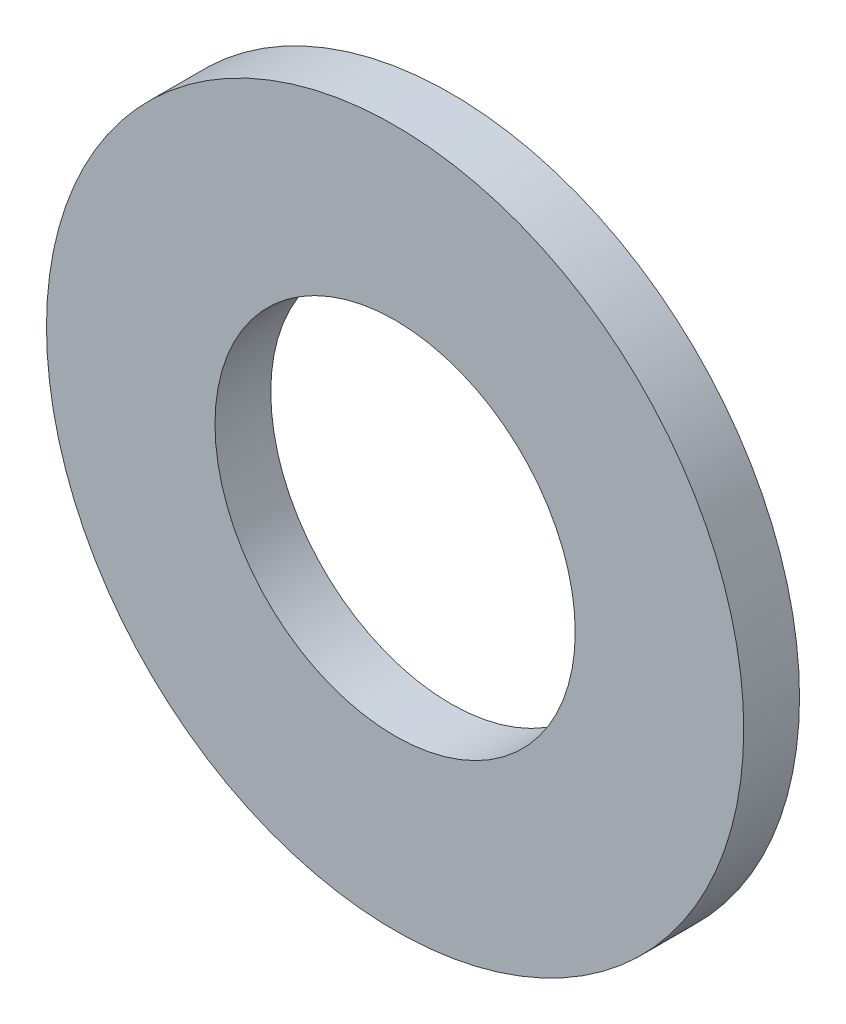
ISO-10303-21;
HEADER;
FILE_DESCRIPTION(('STEP AP214'),'2;1');
FILE_NAME('part.step','',(''),(''),'','','');
FILE_SCHEMA(('AUTOMOTIVE_DESIGN { 1 0 10303 214 1 1 1 1 }'));
ENDSEC;
DATA;
#1=APPLICATION_CONTEXT('core data for automotive mechanical design processes');
#2=APPLICATION_PROTOCOL_DEFINITION('international standard','automotive_design',2000,#1);
#3=PRODUCT_CONTEXT('',#1,'mechanical');
#4=PRODUCT('Part','Part','',(#3));
#5=PRODUCT_RELATED_PRODUCT_CATEGORY('part','',(#4));
#6=PRODUCT_DEFINITION_FORMATION('','',#4);
#7=PRODUCT_DEFINITION_CONTEXT('part definition',#1,'design');
#8=PRODUCT_DEFINITION('design','',#6,#7);
#9=PRODUCT_DEFINITION_SHAPE('','',#8);
#10=(LENGTH_UNIT() NAMED_UNIT(*) SI_UNIT(.MILLI.,.METRE.));
#11=(NAMED_UNIT(*) PLANE_ANGLE_UNIT() SI_UNIT($,.RADIAN.));
#12=(NAMED_UNIT(*) SI_UNIT($,.STERADIAN.) SOLID_ANGLE_UNIT());
#13=UNCERTAINTY_MEASURE_WITH_UNIT(LENGTH_MEASURE(1.E-05),#10,'distance_accuracy_value','');
#14=(GEOMETRIC_REPRESENTATION_CONTEXT(3) GLOBAL_UNCERTAINTY_ASSIGNED_CONTEXT((#13)) GLOBAL_UNIT_ASSIGNED_CONTEXT((#10,
#11,#12)) REPRESENTATION_CONTEXT('',''));
#15=CARTESIAN_POINT('',(0.,0.,0.));
#16=DIRECTION('',(0.,0.,1.));
#17=DIRECTION('',(1.,0.,0.));
#18=AXIS2_PLACEMENT_3D('',#15,#16,#17);
#19=CARTESIAN_POINT('',(0.,0.,1.524));
#20=DIRECTION('',(0.,0.,1.));
#21=DIRECTION('',(1.,0.,0.));
#22=AXIS2_PLACEMENT_3D('',#19,#20,#21);
#23=PLANE('',#22);
#24=CARTESIAN_POINT('',(0.,0.,1.524));
#25=DIRECTION('',(0.,0.,1.));
#26=DIRECTION('',(1.,0.,0.));
#27=AXIS2_PLACEMENT_3D('',#24,#25,#26);
#28=CIRCLE('',#27,9.525);
#29=CARTESIAN_POINT('',(-9.525,0.,1.524));
#30=VERTEX_POINT('',#29);
#31=EDGE_CURVE('E10',#30,#30,#28,.T.);
#32=ORIENTED_EDGE('',*,*,#31,.T.);
#33=EDGE_LOOP('',(#32));
#34=FACE_BOUND('',#33,.T.);
#35=CARTESIAN_POINT('',(0.,0.,1.524));
#36=DIRECTION('',(0.,0.,1.));
#37=DIRECTION('',(1.,0.,0.));
#38=AXIS2_PLACEMENT_3D('',#35,#36,#37);
#39=CIRCLE('',#38,4.92125);
#40=CARTESIAN_POINT('',(-4.92125,0.,1.524));
#41=VERTEX_POINT('',#40);
#42=EDGE_CURVE('E39',#41,#41,#39,.T.);
#43=ORIENTED_EDGE('',*,*,#42,.F.);
#44=EDGE_LOOP('',(#43));
#45=FACE_BOUND('',#44,.T.);
#46=ADVANCED_FACE('F28',(#34,#45),#23,.T.);
#47=CARTESIAN_POINT('',(0.,0.,0.));
#48=DIRECTION('',(0.,0.,1.));
#49=DIRECTION('',(1.,0.,0.));
#50=AXIS2_PLACEMENT_3D('',#47,#48,#49);
#51=PLANE('',#50);
#52=CARTESIAN_POINT('',(0.,0.,0.));
#53=DIRECTION('',(0.,0.,1.));
#54=DIRECTION('',(1.,0.,0.));
#55=AXIS2_PLACEMENT_3D('',#52,#53,#54);
#56=CIRCLE('',#55,9.525);
#57=CARTESIAN_POINT('',(-9.525,0.,0.));
#58=VERTEX_POINT('',#57);
#59=EDGE_CURVE('E35',#58,#58,#56,.T.);
#60=ORIENTED_EDGE('',*,*,#59,.F.);
#61=EDGE_LOOP('',(#60));
#62=FACE_BOUND('',#61,.T.);
#63=CARTESIAN_POINT('',(0.,0.,0.));
#64=DIRECTION('',(0.,0.,1.));
#65=DIRECTION('',(1.,0.,0.));
#66=AXIS2_PLACEMENT_3D('',#63,#64,#65);
#67=CIRCLE('',#66,4.92125);
#68=CARTESIAN_POINT('',(-4.92125,0.,0.));
#69=VERTEX_POINT('',#68);
#70=EDGE_CURVE('E43',#69,#69,#67,.T.);
#71=ORIENTED_EDGE('',*,*,#70,.T.);
#72=EDGE_LOOP('',(#71));
#73=FACE_BOUND('',#72,.T.);
#74=ADVANCED_FACE('F49',(#62,#73),#51,.F.);
#75=CARTESIAN_POINT('',(0.,0.,1.524));
#76=DIRECTION('',(0.,0.,-1.));
#77=DIRECTION('',(-1.,0.,0.));
#78=AXIS2_PLACEMENT_3D('',#75,#76,#77);
#79=CYLINDRICAL_SURFACE('',#78,9.525);
#80=CARTESIAN_POINT('',(-9.525,0.,1.524));
#81=CARTESIAN_POINT('',(-9.525,0.,1.508125));
#82=CARTESIAN_POINT('',(-9.525,0.,1.49225));
#83=CARTESIAN_POINT('',(-9.525,0.,1.4605));
#84=CARTESIAN_POINT('',(-9.525,0.,1.444625));
#85=CARTESIAN_POINT('',(-9.525,0.,1.412875));
#86=CARTESIAN_POINT('',(-9.525,0.,1.397));
#87=CARTESIAN_POINT('',(-9.525,0.,1.36525));
#88=CARTESIAN_POINT('',(-9.525,0.,1.349375));
#89=CARTESIAN_POINT('',(-9.525,0.,1.317625));
#90=CARTESIAN_POINT('',(-9.525,0.,1.30175));
#91=CARTESIAN_POINT('',(-9.525,0.,1.27));
#92=CARTESIAN_POINT('',(-9.525,0.,1.254125));
#93=CARTESIAN_POINT('',(-9.525,0.,1.222375));
#94=CARTESIAN_POINT('',(-9.525,0.,1.2065));
#95=CARTESIAN_POINT('',(-9.525,0.,1.17475));
#96=CARTESIAN_POINT('',(-9.525,0.,1.158875));
#97=CARTESIAN_POINT('',(-9.525,0.,1.127125));
#98=CARTESIAN_POINT('',(-9.525,0.,1.11125));
#99=CARTESIAN_POINT('',(-9.525,0.,1.0795));
#100=CARTESIAN_POINT('',(-9.525,0.,1.063625));
#101=CARTESIAN_POINT('',(-9.525,0.,1.031875));
#102=CARTESIAN_POINT('',(-9.525,0.,1.016));
#103=CARTESIAN_POINT('',(-9.525,0.,0.98425));
#104=CARTESIAN_POINT('',(-9.525,0.,0.968375));
#105=CARTESIAN_POINT('',(-9.525,0.,0.936625));
#106=CARTESIAN_POINT('',(-9.525,0.,0.92075));
#107=CARTESIAN_POINT('',(-9.525,0.,0.889));
#108=CARTESIAN_POINT('',(-9.525,0.,0.873125));
#109=CARTESIAN_POINT('',(-9.525,0.,0.841375));
#110=CARTESIAN_POINT('',(-9.525,0.,0.8255));
#111=CARTESIAN_POINT('',(-9.525,0.,0.79375));
#112=CARTESIAN_POINT('',(-9.525,0.,0.777875));
#113=CARTESIAN_POINT('',(-9.525,0.,0.746125));
#114=CARTESIAN_POINT('',(-9.525,0.,0.73025));
#115=CARTESIAN_POINT('',(-9.525,0.,0.6985));
#116=CARTESIAN_POINT('',(-9.525,0.,0.682625));
#117=CARTESIAN_POINT('',(-9.525,0.,0.650875));
#118=CARTESIAN_POINT('',(-9.525,0.,0.635));
#119=CARTESIAN_POINT('',(-9.525,0.,0.60325));
#120=CARTESIAN_POINT('',(-9.525,0.,0.587375));
#121=CARTESIAN_POINT('',(-9.525,0.,0.555625));
#122=CARTESIAN_POINT('',(-9.525,0.,0.53975));
#123=CARTESIAN_POINT('',(-9.525,0.,0.508));
#124=CARTESIAN_POINT('',(-9.525,0.,0.492125));
#125=CARTESIAN_POINT('',(-9.525,0.,0.460375));
#126=CARTESIAN_POINT('',(-9.525,0.,0.4445));
#127=CARTESIAN_POINT('',(-9.525,0.,0.41275));
#128=CARTESIAN_POINT('',(-9.525,0.,0.396875));
#129=CARTESIAN_POINT('',(-9.525,0.,0.365125));
#130=CARTESIAN_POINT('',(-9.525,0.,0.34925));
#131=CARTESIAN_POINT('',(-9.525,0.,0.3175));
#132=CARTESIAN_POINT('',(-9.525,0.,0.301625));
#133=CARTESIAN_POINT('',(-9.525,0.,0.269875));
#134=CARTESIAN_POINT('',(-9.525,0.,0.254));
#135=CARTESIAN_POINT('',(-9.525,0.,0.22225));
#136=CARTESIAN_POINT('',(-9.525,0.,0.206375));
#137=CARTESIAN_POINT('',(-9.525,0.,0.174625));
#138=CARTESIAN_POINT('',(-9.525,0.,0.15875));
#139=CARTESIAN_POINT('',(-9.525,0.,0.127));
#140=CARTESIAN_POINT('',(-9.525,0.,0.111125));
#141=CARTESIAN_POINT('',(-9.525,0.,0.079375));
#142=CARTESIAN_POINT('',(-9.525,0.,0.0635));
#143=CARTESIAN_POINT('',(-9.525,0.,0.0317499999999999));
#144=CARTESIAN_POINT('',(-9.525,0.,0.015875));
#145=CARTESIAN_POINT('',(-9.525,0.,0.));
#146=B_SPLINE_CURVE_WITH_KNOTS('',3,(#80,#81,#82,#83,#84,#85,#86,#87,#88,#89,#90,#91,#92,#93,
#94,#95,#96,#97,#98,#99,#100,#101,#102,#103,#104,#105,#106,#107,#108,#109,#110,#111,#112,#113,
#114,#115,#116,#117,#118,#119,#120,#121,#122,#123,#124,#125,#126,#127,#128,#129,#130,#131,#132,
#133,#134,#135,#136,#137,#138,#139,#140,#141,#142,#143,#144,#145),.UNSPECIFIED.,.F.,.F.,(4,2,2,
2,2,2,2,2,2,2,2,2,2,2,2,2,2,2,2,2,2,2,2,2,2,2,2,2,2,2,2,2,4),(0.,0.0476250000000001,
0.0952500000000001,0.142875,0.1905,0.238125,0.28575,0.333375,0.381,0.428625,0.47625,0.523875,
0.5715,0.619125,0.66675,0.714375,0.762,0.809625,0.85725,0.904875,0.9525,1.000125,1.04775,
1.095375,1.143,1.190625,1.23825,1.285875,1.3335,1.381125,1.42875,1.476375,1.524),.UNSPECIFIED.);
#147=EDGE_CURVE('BSEAM30',#30,#58,#146,.T.);
#148=ORIENTED_EDGE('',*,*,#31,.F.);
#149=ORIENTED_EDGE('',*,*,#59,.T.);
#150=ORIENTED_EDGE('',*,*,#147,.T.);
#151=ORIENTED_EDGE('',*,*,#147,.F.);
#152=EDGE_LOOP('',(#148,#150,#149,#151));
#153=FACE_BOUND('',#152,.T.);
#154=ADVANCED_FACE('F30',(#153),#79,.T.);
#155=CARTESIAN_POINT('',(0.,0.,1.524));
#156=DIRECTION('',(0.,0.,-1.));
#157=DIRECTION('',(-1.,0.,0.));
#158=AXIS2_PLACEMENT_3D('',#155,#156,#157);
#159=CYLINDRICAL_SURFACE('',#158,4.92125);
#160=CARTESIAN_POINT('',(-4.92125,0.,1.524));
#161=CARTESIAN_POINT('',(-4.92125,0.,1.508125));
#162=CARTESIAN_POINT('',(-4.92125,0.,1.49225));
#163=CARTESIAN_POINT('',(-4.92125,0.,1.4605));
#164=CARTESIAN_POINT('',(-4.92125,0.,1.444625));
#165=CARTESIAN_POINT('',(-4.92125,0.,1.412875));
#166=CARTESIAN_POINT('',(-4.92125,0.,1.397));
#167=CARTESIAN_POINT('',(-4.92125,0.,1.36525));
#168=CARTESIAN_POINT('',(-4.92125,0.,1.349375));
#169=CARTESIAN_POINT('',(-4.92125,0.,1.317625));
#170=CARTESIAN_POINT('',(-4.92125,0.,1.30175));
#171=CARTESIAN_POINT('',(-4.92125,0.,1.27));
#172=CARTESIAN_POINT('',(-4.92125,0.,1.254125));
#173=CARTESIAN_POINT('',(-4.92125,0.,1.222375));
#174=CARTESIAN_POINT('',(-4.92125,0.,1.2065));
#175=CARTESIAN_POINT('',(-4.92125,0.,1.17475));
#176=CARTESIAN_POINT('',(-4.92125,0.,1.158875));
#177=CARTESIAN_POINT('',(-4.92125,0.,1.127125));
#178=CARTESIAN_POINT('',(-4.92125,0.,1.11125));
#179=CARTESIAN_POINT('',(-4.92125,0.,1.0795));
#180=CARTESIAN_POINT('',(-4.92125,0.,1.063625));
#181=CARTESIAN_POINT('',(-4.92125,0.,1.031875));
#182=CARTESIAN_POINT('',(-4.92125,0.,1.016));
#183=CARTESIAN_POINT('',(-4.92125,0.,0.98425));
#184=CARTESIAN_POINT('',(-4.92125,0.,0.968375));
#185=CARTESIAN_POINT('',(-4.92125,0.,0.936625));
#186=CARTESIAN_POINT('',(-4.92125,0.,0.92075));
#187=CARTESIAN_POINT('',(-4.92125,0.,0.889));
#188=CARTESIAN_POINT('',(-4.92125,0.,0.873125));
#189=CARTESIAN_POINT('',(-4.92125,0.,0.841375));
#190=CARTESIAN_POINT('',(-4.92125,0.,0.8255));
#191=CARTESIAN_POINT('',(-4.92125,0.,0.79375));
#192=CARTESIAN_POINT('',(-4.92125,0.,0.777875));
#193=CARTESIAN_POINT('',(-4.92125,0.,0.746125));
#194=CARTESIAN_POINT('',(-4.92125,0.,0.73025));
#195=CARTESIAN_POINT('',(-4.92125,0.,0.6985));
#196=CARTESIAN_POINT('',(-4.92125,0.,0.682625));
#197=CARTESIAN_POINT('',(-4.92125,0.,0.650875));
#198=CARTESIAN_POINT('',(-4.92125,0.,0.635));
#199=CARTESIAN_POINT('',(-4.92125,0.,0.60325));
#200=CARTESIAN_POINT('',(-4.92125,0.,0.587375));
#201=CARTESIAN_POINT('',(-4.92125,0.,0.555625));
#202=CARTESIAN_POINT('',(-4.92125,0.,0.53975));
#203=CARTESIAN_POINT('',(-4.92125,0.,0.508));
#204=CARTESIAN_POINT('',(-4.92125,0.,0.492125));
#205=CARTESIAN_POINT('',(-4.92125,0.,0.460375));
#206=CARTESIAN_POINT('',(-4.92125,0.,0.4445));
#207=CARTESIAN_POINT('',(-4.92125,0.,0.41275));
#208=CARTESIAN_POINT('',(-4.92125,0.,0.396875));
#209=CARTESIAN_POINT('',(-4.92125,0.,0.365125));
#210=CARTESIAN_POINT('',(-4.92125,0.,0.34925));
#211=CARTESIAN_POINT('',(-4.92125,0.,0.3175));
#212=CARTESIAN_POINT('',(-4.92125,0.,0.301625));
#213=CARTESIAN_POINT('',(-4.92125,0.,0.269875));
#214=CARTESIAN_POINT('',(-4.92125,0.,0.254));
#215=CARTESIAN_POINT('',(-4.92125,0.,0.22225));
#216=CARTESIAN_POINT('',(-4.92125,0.,0.206375));
#217=CARTESIAN_POINT('',(-4.92125,0.,0.174625));
#218=CARTESIAN_POINT('',(-4.92125,0.,0.15875));
#219=CARTESIAN_POINT('',(-4.92125,0.,0.127));
#220=CARTESIAN_POINT('',(-4.92125,0.,0.111125));
#221=CARTESIAN_POINT('',(-4.92125,0.,0.079375));
#222=CARTESIAN_POINT('',(-4.92125,0.,0.0635));
#223=CARTESIAN_POINT('',(-4.92125,0.,0.0317499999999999));
#224=CARTESIAN_POINT('',(-4.92125,0.,0.015875));
#225=CARTESIAN_POINT('',(-4.92125,0.,0.));
#226=B_SPLINE_CURVE_WITH_KNOTS('',3,(#160,#161,#162,#163,#164,#165,#166,#167,#168,#169,#170,
#171,#172,#173,#174,#175,#176,#177,#178,#179,#180,#181,#182,#183,#184,#185,#186,#187,#188,#189,
#190,#191,#192,#193,#194,#195,#196,#197,#198,#199,#200,#201,#202,#203,#204,#205,#206,#207,#208,
#209,#210,#211,#212,#213,#214,#215,#216,#217,#218,#219,#220,#221,#222,#223,#224,#225),
.UNSPECIFIED.,.F.,.F.,(4,2,2,2,2,2,2,2,2,2,2,2,2,2,2,2,2,2,2,2,2,2,2,2,2,2,2,2,2,2,2,2,4),(0.,
0.0476249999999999,0.0952499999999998,0.142875,0.1905,0.238125,0.28575,0.333375,0.381,0.428625,
0.47625,0.523875,0.5715,0.619125,0.66675,0.714375,0.762,0.809625,0.85725,0.904875,0.9525,
1.000125,1.04775,1.095375,1.143,1.190625,1.23825,1.285875,1.3335,1.381125,1.42875,1.476375,
1.524),.UNSPECIFIED.);
#227=EDGE_CURVE('BSEAM51',#41,#69,#226,.T.);
#228=ORIENTED_EDGE('',*,*,#42,.T.);
#229=ORIENTED_EDGE('',*,*,#70,.F.);
#230=ORIENTED_EDGE('',*,*,#227,.T.);
#231=ORIENTED_EDGE('',*,*,#227,.F.);
#232=EDGE_LOOP('',(#228,#230,#229,#231));
#233=FACE_BOUND('',#232,.T.);
#234=ADVANCED_FACE('F51',(#233),#159,.F.);
#235=CLOSED_SHELL('',(#46,#74,#154,#234));
#236=MANIFOLD_SOLID_BREP('B2',#235);
#237=ADVANCED_BREP_SHAPE_REPRESENTATION('',(#18,#236),#14);
#238=SHAPE_DEFINITION_REPRESENTATION(#9,#237);
ENDSEC;
END-ISO-10303-21;
